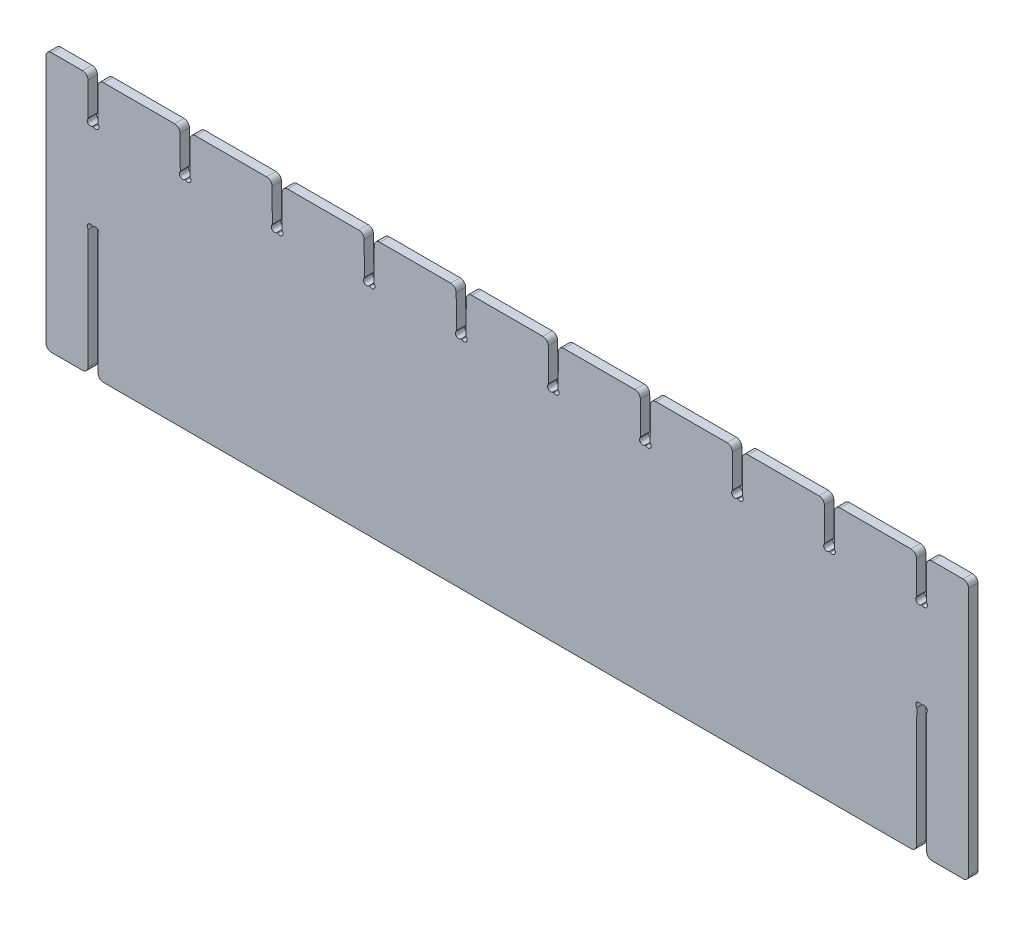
from build123d import *

# Parameters (mm, degrees)
ESQUISSE1_W         = 588.5
ESQUISSE1_H         = 331.2
BOSS_EXTRUDE1_DEPTH = 12
CUT_EXTRUDE1_DEPTH  = 676.40335356
CUT_EXTRUDE4_DEPTH  = 676.40335356
LPATTERN1_COUNT     = 5
LPATTERN1_PITCH     = 117.444444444
CONG_1_R            = 7


with BuildPart() as part:
    # Esquisse1 → Boss-Extrude1 (new body)
    with BuildSketch(Plane.XY):
        with Locations((294.25, 165.6)):
            Rectangle(ESQUISSE1_W, ESQUISSE1_H)
    extrude(amount=BOSS_EXTRUDE1_DEPTH)

    # Esquisse2 → Cut-Extrude1 (cut, through all)
    with BuildSketch(Plane.XY.offset(12)):
        with BuildLine():
            Line((59.867332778, 165.6), (60.132667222, 165.6))
            ThreePointArc((60.132667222, 165.6), (60.514806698, 165.662472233), (60.857157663, 165.843384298))
            ThreePointArc((60.857157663, 165.843384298), (66.334370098, 165.367576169), (66.41388626, 159.870310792))
            ThreePointArc((66.41388626, 159.870310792), (66.192248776, 159.500293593), (66.11575891, 159.075811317))
            Line((66.11575891, 159.075811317), (66.5, 0))
            Line((66.5, 0), (53.5, 0))
            Line((53.5, 0), (53.88424109, 159.075811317))
            ThreePointArc((53.88424109, 159.075811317), (53.807751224, 159.500293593), (53.58611374, 159.870310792))
            ThreePointArc((53.58611374, 159.870310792), (53.665629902, 165.367576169), (59.142842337, 165.843384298))
            ThreePointArc((59.142842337, 165.843384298), (59.485193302, 165.662472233), (59.867332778, 165.6))
        make_face()
    extrude(amount=-CUT_EXTRUDE1_DEPTH, mode=Mode.SUBTRACT)

    # Sketch3 → Cut-Extrude4 (cut, through all)
    with BuildSketch(Plane.XY):
        with BuildLine():
            Line((53.852941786, 282.494033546), (53.5, 331.2))
            Line((53.5, 331.2), (66.5, 331.2))
            Line((66.5, 331.2), (66.147058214, 282.494033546))
            ThreePointArc((66.147058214, 282.494033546), (66.220633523, 282.071528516), (66.438077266, 281.701877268))
            ThreePointArc((66.438077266, 281.701877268), (66.321786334, 276.218958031), (60.857157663, 275.756615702))
            ThreePointArc((60.857157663, 275.756615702), (60.514806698, 275.937527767), (60.132667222, 276))
            Line((60.132667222, 276), (59.867332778, 276))
            ThreePointArc((59.867332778, 276), (59.485193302, 275.937527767), (59.142842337, 275.756615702))
            ThreePointArc((59.142842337, 275.756615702), (53.678213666, 276.218958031), (53.561922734, 281.701877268))
            ThreePointArc((53.561922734, 281.701877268), (53.779366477, 282.071528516), (53.852941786, 282.494033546))
        make_face()
    cut_extrude4 = extrude(amount=CUT_EXTRUDE4_DEPTH, mode=Mode.SUBTRACT)

    # LPattern1: Cut-Extrude4 ×5
    with Locations(*[(i * LPATTERN1_PITCH, 0, 0) for i in range(1, LPATTERN1_COUNT)]):
        add(cut_extrude4, mode=Mode.SUBTRACT)

    # Cong_1
    cong_1_edges = [part.edges().sort_by_distance(p)[0] for p in [
        (301.388888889, 331.2, 6),
        (288.388888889, 331.2, 6),
        (418.833333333, 331.2, 6),
        (405.833333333, 331.2, 6),
        (536.277777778, 331.2, 6),
        (523.277777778, 331.2, 6),
        (66.5, 0, 6),
        (53.5, 0, 6),
        (66.5, 331.2, 6),
        (53.5, 331.2, 6),
        (0, 331.2, 6),
        (0, 0, 6),
        (183.944444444, 331.2, 6),
        (170.944444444, 331.2, 6),
    ]]
    fillet(cong_1_edges, radius=CONG_1_R)

    # Sym_trie1: part across plane


with BuildPart() as part_1:
    add(part.part)
    add(part.part.mirror(Plane(origin=(588.5, 0, 12), x_dir=(0, 0, 1), z_dir=(-1, 0, 0))))


solid = part_1.part
